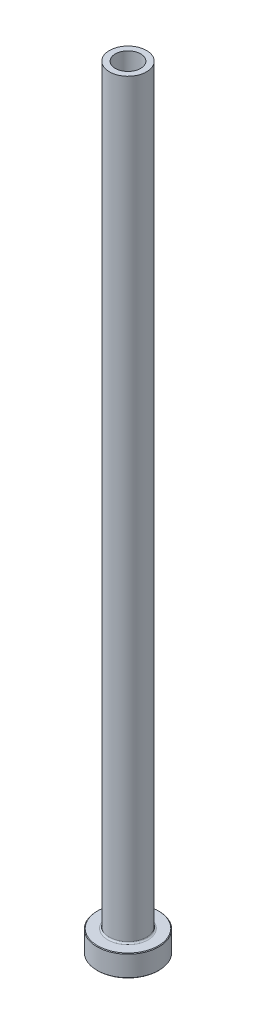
from build123d import *

# Parameters (mm, degrees)
FILLET1_R     = 0.5
CHAMFER1_SIZE = 0.2
CHAMFER3_SIZE = 0.5


with BuildPart() as part:
    # Sketch1 → Revolve1 (revolve)
    with BuildSketch(Plane.XY, mode=Mode.PRIVATE) as revolve1_sk:
        Polygon((-4.1, 250), (-6, 250), (-6, 7), (-10, 7), (-10, 0), (-4.35, 0), (-4.35, 193), (-4.1, 205), align=None)
    revolve(revolve1_sk.sketch.rotate(Axis((0, 92.187680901, 0), (0, -1, 0)), 270), axis=Axis((0, 92.187680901, 0), (0, -1, 0)))

    # Fillet1
    fillet1_edges = [part.edges().sort_by_distance(p)[0] for p in [
        (0, 7, -6),
    ]]
    fillet(fillet1_edges, radius=FILLET1_R)

    # Chamfer1
    chamfer1_edges = [part.edges().sort_by_distance(p)[0] for p in [
        (0, 0, -10),
        (0, 7, -10),
    ]]
    chamfer(chamfer1_edges, length=CHAMFER1_SIZE)

    # Chamfer3
    chamfer3_edges = [part.edges().sort_by_distance(p)[0] for p in [
        (0, 0, -4.35),
    ]]
    chamfer(chamfer3_edges, length=CHAMFER3_SIZE)


solid = part.part
